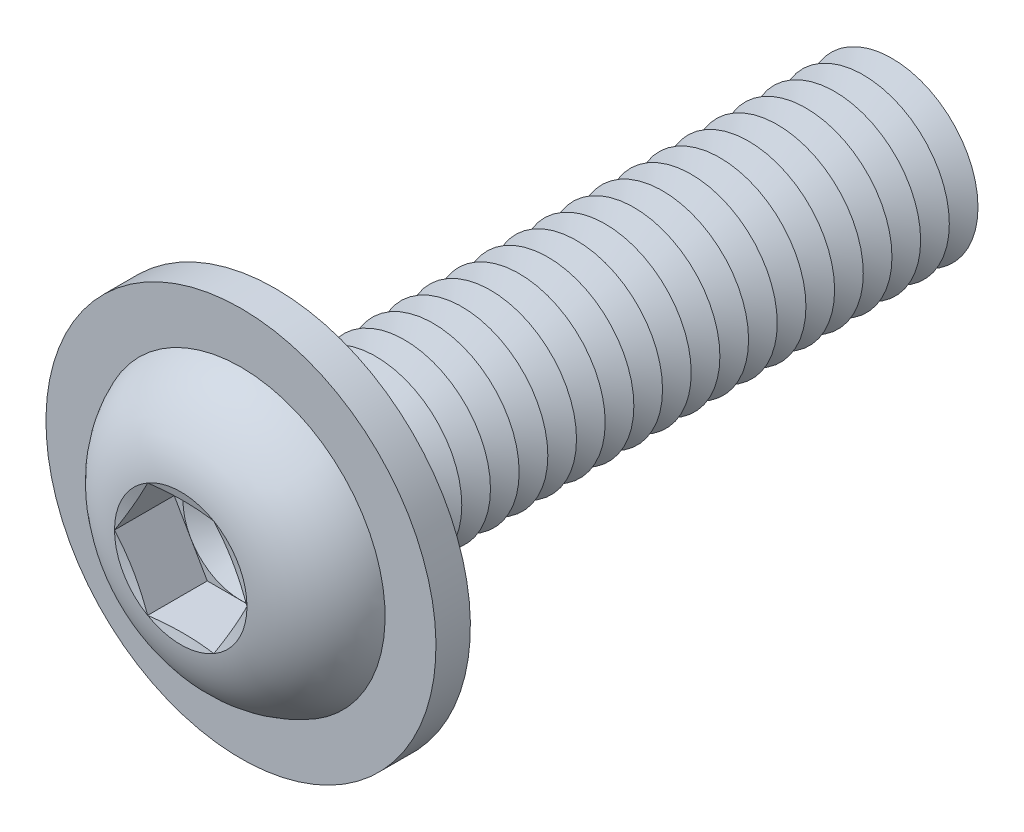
from build123d import *

# Parameters (mm, degrees)
FILLET1_R           = 0.5
LPATTERN1_COUNT     = 22
LPATTERN1_PITCH     = 1
CUT_EXTRUDE1_DEPTH  = 2.08
SKETCH5_R           = 6.8
SKETCH5_R_2         = 3.5
BOSS_EXTRUDE1_DEPTH = 1.2


with BuildPart() as part:
    # Sketch1 → Revolve1 (revolve)
    with BuildSketch(Plane(origin=(0, 0, 0), x_dir=(0, 0, -1), z_dir=(1, 0, 0)), mode=Mode.PRIVATE) as revolve1_sk:
        with BuildLine():
            Line((0, 3), (0, 5.25))
            ThreePointArc((0, 5.25), (-2.210041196, 4.408189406), (-3.3, 2.3094))
            Line((-3.3, 2.3094), (-2.990599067, 1.1547))
            Line((-2.990599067, 1.1547), (-3.3, 1.1547))
            Line((-3.3, 1.1547), (-3.3, 0))
            Line((-3.3, 0), (22, 0))
            Line((22, 0), (22, 3))
            Line((22, 3), (0, 3))
        make_face()
    revolve(revolve1_sk.sketch.rotate(Axis((0, 0, -22), (0, 0, 1)), 90), axis=Axis((0, 0, -22), (0, 0, 1)))

    # Fillet1
    fillet1_edges = [part.edges().sort_by_distance(p)[0] for p in [
        (3, 0, 0),
    ]]
    fillet(fillet1_edges, radius=FILLET1_R)

    # Sketch2 → Cut-Revolve1 (revolve, cut)
    with BuildSketch(Plane(origin=(0, 0, 0), x_dir=(0, 0, -1), z_dir=(1, 0, 0)), mode=Mode.PRIVATE) as cut_revolve1_sk:
        Polygon((21.5, 3), (22.5, 3), (22, 2.133974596), align=None)
    cut_revolve1 = revolve(cut_revolve1_sk.sketch.rotate(Axis((0, 0, -22), (0, 0, -1)), 270), axis=Axis((0, 0, -22), (0, 0, -1)), mode=Mode.SUBTRACT)

    # LPattern1: Cut-Revolve1 ×22
    with Locations(*[(0, 0, i * LPATTERN1_PITCH) for i in range(1, LPATTERN1_COUNT)]):
        add(cut_revolve1, mode=Mode.SUBTRACT)

    # Sketch3 → Cut-Extrude1 (cut)
    with BuildSketch(Plane.XY.offset(3.3)):
        Polygon((1.1547, 1.999999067), (-1.1547, 1.999999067), (-2.3094, 0), (-1.1547, -1.999999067), (1.1547, -1.999999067), (2.3094, 0), align=None)
    extrude(amount=-CUT_EXTRUDE1_DEPTH, mode=Mode.SUBTRACT)

    # Cut-Extrude2 cone 1 section (on through the dimple's axis) → Cut-Extrude2 (revolve, cut)
    with BuildSketch(Plane(origin=(0, 0, 1.22), x_dir=(0, -1, 0), z_dir=(1, 0, 0))):
        Polygon((0, 0), (1.999999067, 0), (0, 1.1547), align=None)
    revolve(axis=Axis((0, 0, 1.22), (0, 0, -1)), mode=Mode.SUBTRACT)

    # Sketch5 → Boss-Extrude1 (add)
    with BuildSketch(Plane(origin=(0, 0, 0), x_dir=(-1, 0, 0), z_dir=(0, 0, -1))):
        with Locations(Location((0, 0, 0), (0, 0, 90))):
            Circle(SKETCH5_R)
        Circle(SKETCH5_R_2, mode=Mode.SUBTRACT)
    extrude(amount=-BOSS_EXTRUDE1_DEPTH)


solid = part.part
